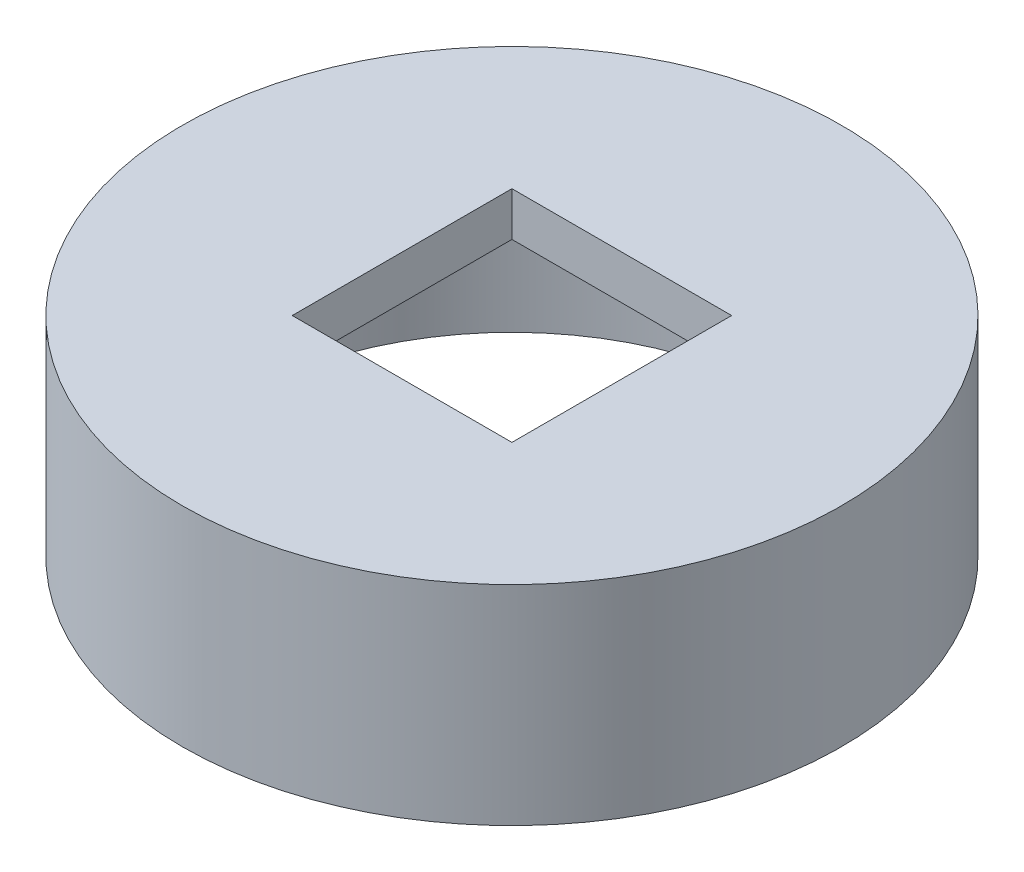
from build123d import *

# Parameters (mm, degrees)
SKETCH2_R           = 60
SKETCH2_R_2         = 50
BOSS_EXTRUDE1_DEPTH = 30
SKETCH3_R           = 60
BOSS_EXTRUDE2_DEPTH = 8
SKETCH5_W           = 40
SKETCH5_H           = 40
CUT_EXTRUDE1_DEPTH  = 93.973114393


with BuildPart() as part:
    # Sketch2 → Boss-Extrude1 (new body)
    with BuildSketch(Plane(origin=(0, 0, 0), x_dir=(1, 0, 0), z_dir=(0, 1, 0))):
        with Locations(Location((0, 0, 0), (0, 0, 270))):
            Circle(SKETCH2_R)
        with Locations(Location((0, 0, 0), (0, 0, 270))):
            Circle(SKETCH2_R_2, mode=Mode.SUBTRACT)
    extrude(amount=BOSS_EXTRUDE1_DEPTH)

    # Sketch3 → Boss-Extrude2 (add)
    with BuildSketch(Plane(origin=(0, 30, 0), x_dir=(1, 0, 0), z_dir=(0, 1, 0))):
        with Locations(Location((0, 0, 0), (0, 0, 270))):
            Circle(SKETCH3_R)
    extrude(amount=BOSS_EXTRUDE2_DEPTH)

    # Sketch5 → Cut-Extrude1 (cut, through all)
    with BuildSketch(Plane(origin=(0, 38, 0), x_dir=(1, 0, 0), z_dir=(0, 1, 0))):
        Rectangle(SKETCH5_W, SKETCH5_H)
    extrude(amount=-CUT_EXTRUDE1_DEPTH, mode=Mode.SUBTRACT)


solid = part.part
